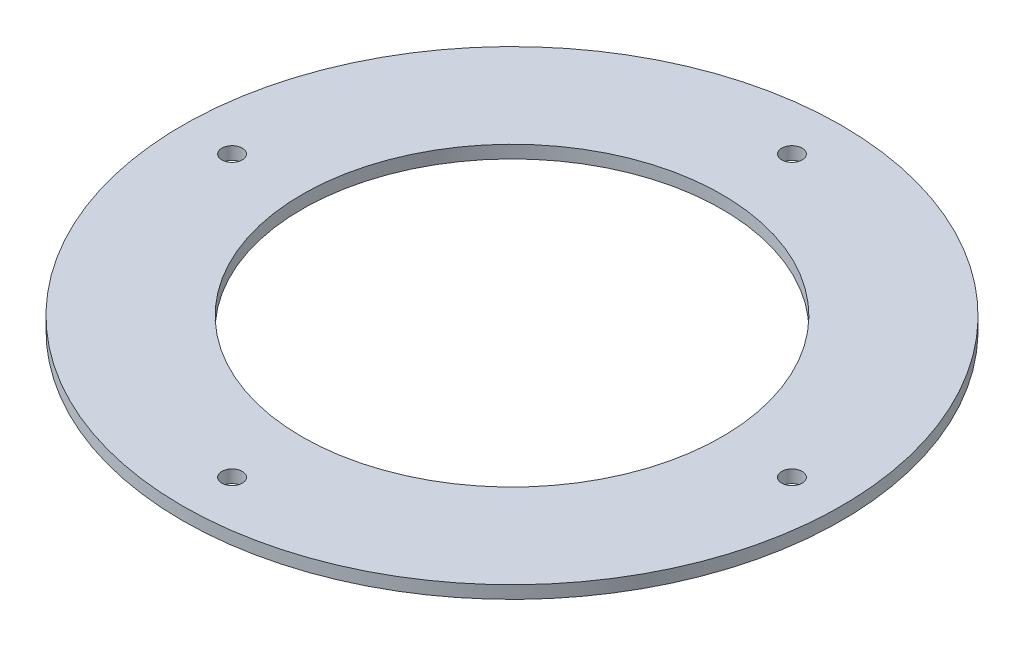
from build123d import *

# Parameters (mm, degrees)
SKETCH1_R              = 82.2325
SKETCH1_R_2            = 52.3875
BOSS_EXTRUDE1_DEPTH    = 3.175
F_10_CLEARANCE_HOLE1_D = 5.1054


with BuildPart() as part:
    # Sketch1 → Boss-Extrude1 (new body)
    with BuildSketch(Plane(origin=(0, 0, 0), x_dir=(1, 0, 0), z_dir=(0, 1, 0))):
        with Locations(Location((0, 0, 0), (0, 0, 270))):
            Circle(SKETCH1_R)
        with Locations(Location((0, 0, 0), (0, 0, 270))):
            Circle(SKETCH1_R_2, mode=Mode.SUBTRACT)
    extrude(amount=BOSS_EXTRUDE1_DEPTH)

    # 10 Clearance Hole1 (through all)
    with Locations(Plane(origin=(0, 3.175, 0), x_dir=(1, 0, 0), z_dir=(0, 1, 0))):
        with Locations((0, 69.85), (69.85, 0), (0, -69.85), (-69.85, 0)):
            Hole(F_10_CLEARANCE_HOLE1_D / 2)


solid = part.part
